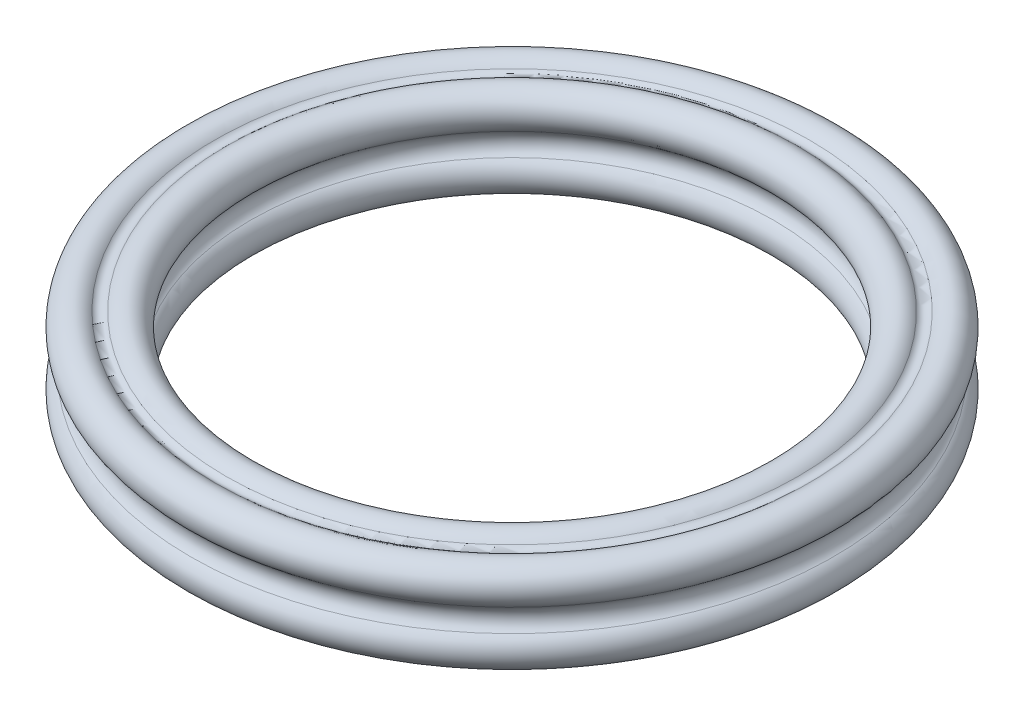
ISO-10303-21;
HEADER;
FILE_DESCRIPTION(('STEP AP214'),'2;1');
FILE_NAME('part.step','',(''),(''),'','','');
FILE_SCHEMA(('AUTOMOTIVE_DESIGN { 1 0 10303 214 1 1 1 1 }'));
ENDSEC;
DATA;
#1=APPLICATION_CONTEXT('core data for automotive mechanical design processes');
#2=APPLICATION_PROTOCOL_DEFINITION('international standard','automotive_design',2000,#1);
#3=PRODUCT_CONTEXT('',#1,'mechanical');
#4=PRODUCT('Part','Part','',(#3));
#5=PRODUCT_RELATED_PRODUCT_CATEGORY('part','',(#4));
#6=PRODUCT_DEFINITION_FORMATION('','',#4);
#7=PRODUCT_DEFINITION_CONTEXT('part definition',#1,'design');
#8=PRODUCT_DEFINITION('design','',#6,#7);
#9=PRODUCT_DEFINITION_SHAPE('','',#8);
#10=(LENGTH_UNIT() NAMED_UNIT(*) SI_UNIT(.MILLI.,.METRE.));
#11=(NAMED_UNIT(*) PLANE_ANGLE_UNIT() SI_UNIT($,.RADIAN.));
#12=(NAMED_UNIT(*) SI_UNIT($,.STERADIAN.) SOLID_ANGLE_UNIT());
#13=UNCERTAINTY_MEASURE_WITH_UNIT(LENGTH_MEASURE(1.E-05),#10,'distance_accuracy_value','');
#14=(GEOMETRIC_REPRESENTATION_CONTEXT(3) GLOBAL_UNCERTAINTY_ASSIGNED_CONTEXT((#13)) GLOBAL_UNIT_ASSIGNED_CONTEXT((#10,
#11,#12)) REPRESENTATION_CONTEXT('',''));
#15=CARTESIAN_POINT('',(0.,0.,0.));
#16=DIRECTION('',(0.,0.,1.));
#17=DIRECTION('',(1.,0.,0.));
#18=AXIS2_PLACEMENT_3D('',#15,#16,#17);
#19=CARTESIAN_POINT('',(0.,1.45000000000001,0.));
#20=DIRECTION('',(0.,1.,0.));
#21=DIRECTION('',(0.,0.,1.));
#22=AXIS2_PLACEMENT_3D('',#19,#20,#21);
#23=TOROIDAL_SURFACE('',#22,9.2,0.248528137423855);
#24=CARTESIAN_POINT('',(0.,1.27426406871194,0.));
#25=DIRECTION('',(0.,1.,0.));
#26=DIRECTION('',(0.,0.,1.));
#27=AXIS2_PLACEMENT_3D('',#24,#25,#26);
#28=CIRCLE('',#27,9.02426406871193);
#29=CARTESIAN_POINT('',(0.,1.27426406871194,9.02426406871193));
#30=VERTEX_POINT('',#29);
#31=EDGE_CURVE('E10',#30,#30,#28,.T.);
#32=ORIENTED_EDGE('',*,*,#31,.F.);
#33=EDGE_LOOP('',(#32));
#34=FACE_BOUND('',#33,.T.);
#35=CARTESIAN_POINT('',(0.,1.27426406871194,0.));
#36=DIRECTION('',(0.,1.,0.));
#37=DIRECTION('',(0.,0.,1.));
#38=AXIS2_PLACEMENT_3D('',#35,#36,#37);
#39=CIRCLE('',#38,9.37573593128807);
#40=CARTESIAN_POINT('',(0.,1.27426406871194,9.37573593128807));
#41=VERTEX_POINT('',#40);
#42=EDGE_CURVE('E60',#41,#41,#39,.T.);
#43=ORIENTED_EDGE('',*,*,#42,.T.);
#44=EDGE_LOOP('',(#43));
#45=FACE_BOUND('',#44,.T.);
#46=ADVANCED_FACE('F32',(#34,#45),#23,.F.);
#47=CARTESIAN_POINT('',(0.,0.850000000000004,0.));
#48=DIRECTION('',(0.,1.,0.));
#49=DIRECTION('',(0.,0.,1.));
#50=AXIS2_PLACEMENT_3D('',#47,#48,#49);
#51=TOROIDAL_SURFACE('',#50,8.6,0.6);
#52=CARTESIAN_POINT('',(0.,0.359819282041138,0.));
#53=DIRECTION('',(0.,1.,0.));
#54=DIRECTION('',(0.,0.,1.));
#55=AXIS2_PLACEMENT_3D('',#52,#53,#54);
#56=CIRCLE('',#55,8.25399008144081);
#57=CARTESIAN_POINT('',(0.,0.359819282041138,8.25399008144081));
#58=VERTEX_POINT('',#57);
#59=EDGE_CURVE('E38',#58,#58,#56,.T.);
#60=ORIENTED_EDGE('',*,*,#59,.F.);
#61=EDGE_LOOP('',(#60));
#62=FACE_BOUND('',#61,.T.);
#63=ORIENTED_EDGE('',*,*,#31,.T.);
#64=EDGE_LOOP('',(#63));
#65=FACE_BOUND('',#64,.T.);
#66=ADVANCED_FACE('F97',(#62,#65),#51,.T.);
#67=CARTESIAN_POINT('',(0.,0.,0.));
#68=DIRECTION('',(0.,1.,0.));
#69=DIRECTION('',(0.,0.,1.));
#70=AXIS2_PLACEMENT_3D('',#67,#68,#69);
#71=TOROIDAL_SURFACE('',#70,8.,0.44043260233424);
#72=CARTESIAN_POINT('',(0.,-0.359819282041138,0.));
#73=DIRECTION('',(0.,1.,0.));
#74=DIRECTION('',(0.,0.,1.));
#75=AXIS2_PLACEMENT_3D('',#72,#73,#74);
#76=CIRCLE('',#75,8.2539900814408);
#77=CARTESIAN_POINT('',(0.,-0.359819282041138,8.2539900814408));
#78=VERTEX_POINT('',#77);
#79=EDGE_CURVE('E42',#78,#78,#76,.T.);
#80=ORIENTED_EDGE('',*,*,#79,.F.);
#81=EDGE_LOOP('',(#80));
#82=FACE_BOUND('',#81,.T.);
#83=ORIENTED_EDGE('',*,*,#59,.T.);
#84=EDGE_LOOP('',(#83));
#85=FACE_BOUND('',#84,.T.);
#86=ADVANCED_FACE('F92',(#82,#85),#71,.F.);
#87=CARTESIAN_POINT('',(0.,-0.850000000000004,0.));
#88=DIRECTION('',(0.,1.,0.));
#89=DIRECTION('',(0.,0.,1.));
#90=AXIS2_PLACEMENT_3D('',#87,#88,#89);
#91=TOROIDAL_SURFACE('',#90,8.6,0.599999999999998);
#92=CARTESIAN_POINT('',(0.,-1.27426406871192,0.));
#93=DIRECTION('',(0.,1.,0.));
#94=DIRECTION('',(0.,0.,1.));
#95=AXIS2_PLACEMENT_3D('',#92,#93,#94);
#96=CIRCLE('',#95,9.02426406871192);
#97=CARTESIAN_POINT('',(0.,-1.27426406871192,9.02426406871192));
#98=VERTEX_POINT('',#97);
#99=EDGE_CURVE('E46',#98,#98,#96,.T.);
#100=ORIENTED_EDGE('',*,*,#99,.F.);
#101=EDGE_LOOP('',(#100));
#102=FACE_BOUND('',#101,.T.);
#103=ORIENTED_EDGE('',*,*,#79,.T.);
#104=EDGE_LOOP('',(#103));
#105=FACE_BOUND('',#104,.T.);
#106=ADVANCED_FACE('F86',(#102,#105),#91,.T.);
#107=CARTESIAN_POINT('',(0.,-1.45000000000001,0.));
#108=DIRECTION('',(0.,1.,0.));
#109=DIRECTION('',(0.,0.,1.));
#110=AXIS2_PLACEMENT_3D('',#107,#108,#109);
#111=TOROIDAL_SURFACE('',#110,9.19999999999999,0.248528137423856);
#112=CARTESIAN_POINT('',(0.,-1.27426406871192,0.));
#113=DIRECTION('',(0.,1.,0.));
#114=DIRECTION('',(0.,0.,1.));
#115=AXIS2_PLACEMENT_3D('',#112,#113,#114);
#116=CIRCLE('',#115,9.37573593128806);
#117=CARTESIAN_POINT('',(0.,-1.27426406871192,9.37573593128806));
#118=VERTEX_POINT('',#117);
#119=EDGE_CURVE('E51',#118,#118,#116,.T.);
#120=ORIENTED_EDGE('',*,*,#119,.F.);
#121=EDGE_LOOP('',(#120));
#122=FACE_BOUND('',#121,.T.);
#123=ORIENTED_EDGE('',*,*,#99,.T.);
#124=EDGE_LOOP('',(#123));
#125=FACE_BOUND('',#124,.T.);
#126=ADVANCED_FACE('F80',(#122,#125),#111,.F.);
#127=CARTESIAN_POINT('',(0.,-0.850000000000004,0.));
#128=DIRECTION('',(0.,1.,0.));
#129=DIRECTION('',(0.,0.,1.));
#130=AXIS2_PLACEMENT_3D('',#127,#128,#129);
#131=TOROIDAL_SURFACE('',#130,9.79999999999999,0.6);
#132=CARTESIAN_POINT('',(0.,-0.359819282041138,0.));
#133=DIRECTION('',(0.,1.,0.));
#134=DIRECTION('',(0.,0.,1.));
#135=AXIS2_PLACEMENT_3D('',#132,#133,#134);
#136=CIRCLE('',#135,10.1460099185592);
#137=CARTESIAN_POINT('',(0.,-0.359819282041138,10.1460099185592));
#138=VERTEX_POINT('',#137);
#139=EDGE_CURVE('E54',#138,#138,#136,.T.);
#140=ORIENTED_EDGE('',*,*,#139,.F.);
#141=EDGE_LOOP('',(#140));
#142=FACE_BOUND('',#141,.T.);
#143=ORIENTED_EDGE('',*,*,#119,.T.);
#144=EDGE_LOOP('',(#143));
#145=FACE_BOUND('',#144,.T.);
#146=ADVANCED_FACE('F74',(#142,#145),#131,.T.);
#147=CARTESIAN_POINT('',(0.,0.,0.));
#148=DIRECTION('',(0.,1.,0.));
#149=DIRECTION('',(0.,0.,1.));
#150=AXIS2_PLACEMENT_3D('',#147,#148,#149);
#151=TOROIDAL_SURFACE('',#150,10.4,0.440432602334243);
#152=CARTESIAN_POINT('',(0.,0.359819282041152,0.));
#153=DIRECTION('',(0.,1.,0.));
#154=DIRECTION('',(0.,0.,1.));
#155=AXIS2_PLACEMENT_3D('',#152,#153,#154);
#156=CIRCLE('',#155,10.1460099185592);
#157=CARTESIAN_POINT('',(0.,0.359819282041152,10.1460099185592));
#158=VERTEX_POINT('',#157);
#159=EDGE_CURVE('E57',#158,#158,#156,.T.);
#160=ORIENTED_EDGE('',*,*,#159,.F.);
#161=EDGE_LOOP('',(#160));
#162=FACE_BOUND('',#161,.T.);
#163=ORIENTED_EDGE('',*,*,#139,.T.);
#164=EDGE_LOOP('',(#163));
#165=FACE_BOUND('',#164,.T.);
#166=ADVANCED_FACE('F68',(#162,#165),#151,.F.);
#167=CARTESIAN_POINT('',(0.,0.850000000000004,0.));
#168=DIRECTION('',(0.,1.,0.));
#169=DIRECTION('',(0.,0.,1.));
#170=AXIS2_PLACEMENT_3D('',#167,#168,#169);
#171=TOROIDAL_SURFACE('',#170,9.8,0.600000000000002);
#172=ORIENTED_EDGE('',*,*,#42,.F.);
#173=EDGE_LOOP('',(#172));
#174=FACE_BOUND('',#173,.T.);
#175=ORIENTED_EDGE('',*,*,#159,.T.);
#176=EDGE_LOOP('',(#175));
#177=FACE_BOUND('',#176,.T.);
#178=ADVANCED_FACE('F65',(#174,#177),#171,.T.);
#179=CLOSED_SHELL('',(#46,#66,#86,#106,#126,#146,#166,#178));
#180=MANIFOLD_SOLID_BREP('B2',#179);
#181=ADVANCED_BREP_SHAPE_REPRESENTATION('',(#18,#180),#14);
#182=SHAPE_DEFINITION_REPRESENTATION(#9,#181);
ENDSEC;
END-ISO-10303-21;
